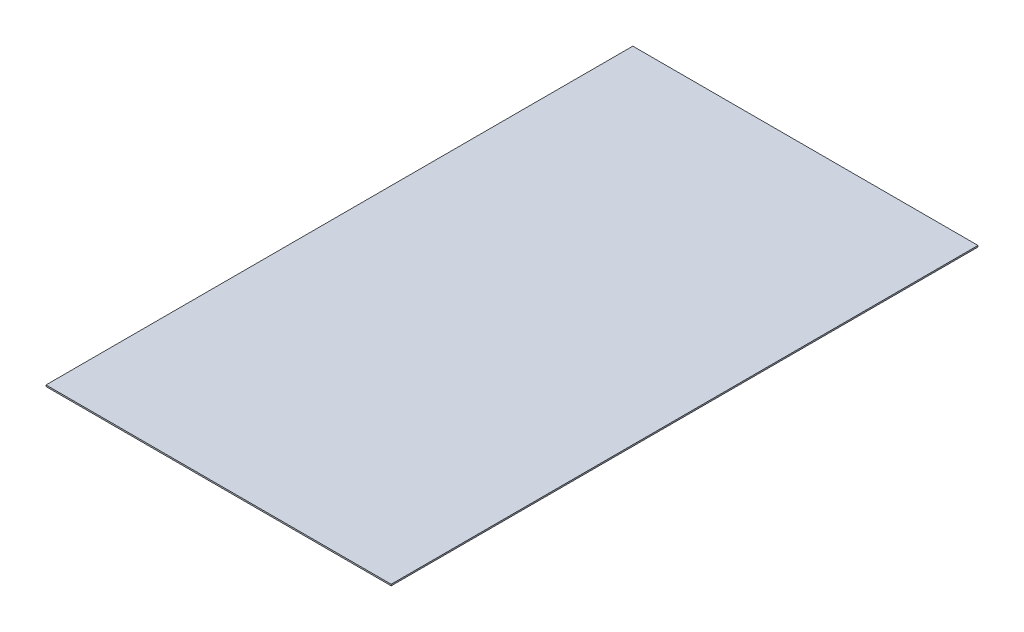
from build123d import *

# Parameters (mm, degrees)
SKETCH1_W           = 1524
SKETCH1_H           = 2590.8
BOSS_EXTRUDE1_DEPTH = 6.35


with BuildPart() as part:
    # Sketch1 → Boss-Extrude1 (new body)
    with BuildSketch(Plane(origin=(0, 0, 0), x_dir=(1, 0, 0), z_dir=(0, 1, 0))):
        with Locations((762, -1295.4)):
            Rectangle(SKETCH1_W, SKETCH1_H)
    extrude(amount=BOSS_EXTRUDE1_DEPTH)


solid = part.part
